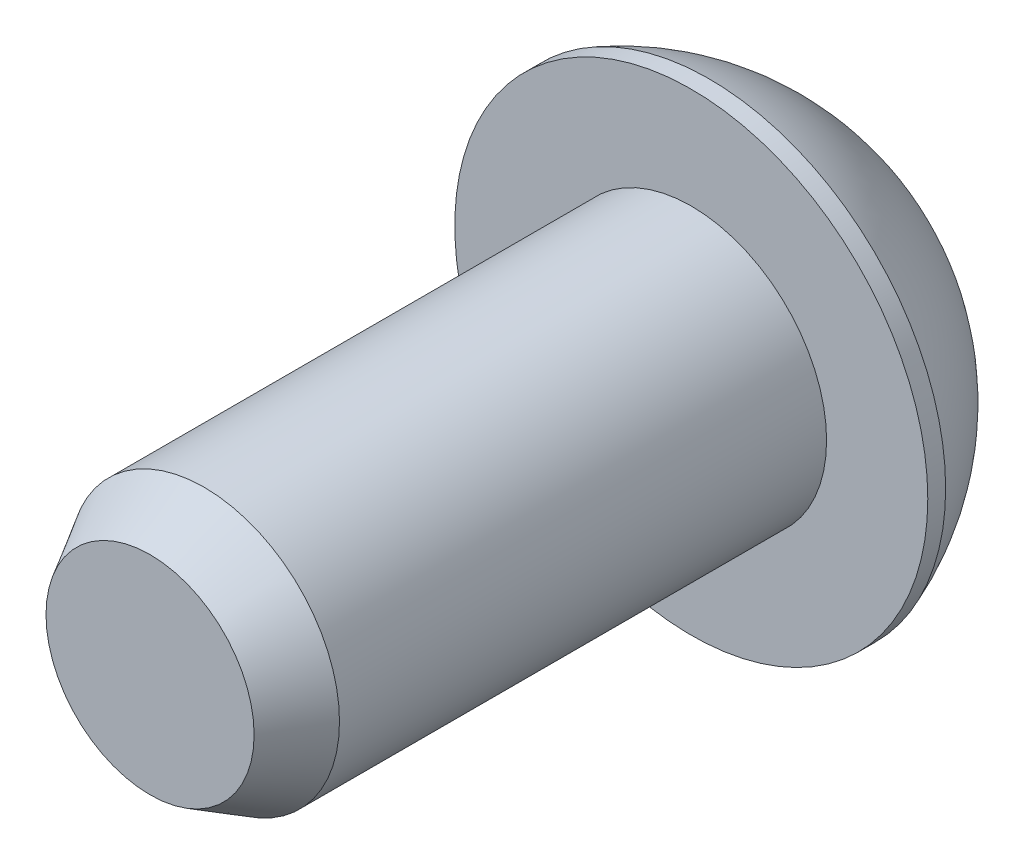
from build123d import *

# Parameters (mm, degrees)
CUT_EXTRUDE1_DEPTH  = 2.2225
SKETCH3_R           = 3.175
BOSS_EXTRUDE1_DEPTH = 12.7
CHAMFER1_SIZE       = 1.27
CHAMFER1_SIZE2      = 0.733234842


with BuildPart() as part:
    # Sketch1 → Revolve1 (revolve)
    with BuildSketch(Plane(origin=(0, 0, 0), x_dir=(1, 0, 0), z_dir=(0, 1, 0))):
        with BuildLine():
            Line((5.549899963, -3.3528), (5.549899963, -2.933699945))
            ThreePointArc((5.549899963, -2.933699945), (4.602457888, -1.27255785), (3.174999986, 0))
            Line((3.174999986, 0), (-1.6e-08, 0))
            Line((-1.6e-08, 0), (-1.6e-08, -3.3528))
            Line((-1.6e-08, -3.3528), (5.549899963, -3.3528))
        make_face()
    revolve(axis=Axis((-1.6e-08, 0, 0), (0, 0, -1)))

    # Sketch2 → Cut-Extrude1 (cut)
    with BuildSketch(Plane(origin=(0, 0, 0), x_dir=(-1, 0, 0), z_dir=(0, 0, -1))):
        Polygon((2.291358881, 0), (1.14567944, 1.984375), (-1.14567944, 1.984375), (-2.291358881, 0), (-1.14567944, -1.984375), (1.14567944, -1.984375), align=None)
    extrude(amount=-CUT_EXTRUDE1_DEPTH, mode=Mode.SUBTRACT)

    # Sketch3 → Boss-Extrude1 (add)
    with BuildSketch(Plane.XY.offset(3.3528)):
        Circle(SKETCH3_R)
    extrude(amount=BOSS_EXTRUDE1_DEPTH)

    # Chamfer1
    chamfer1_edges = [part.edges().sort_by_distance(p)[0] for p in [
        (-3.175, 0, 16.0528),
    ]]
    chamfer1_side = [part.faces().sort_by_distance(p)[0] for p in [
        (-3.175, 0, 9.7028),
    ]]
    chamfer(chamfer1_edges, length=CHAMFER1_SIZE, length2=CHAMFER1_SIZE2, reference=chamfer1_side[0])


solid = part.part
